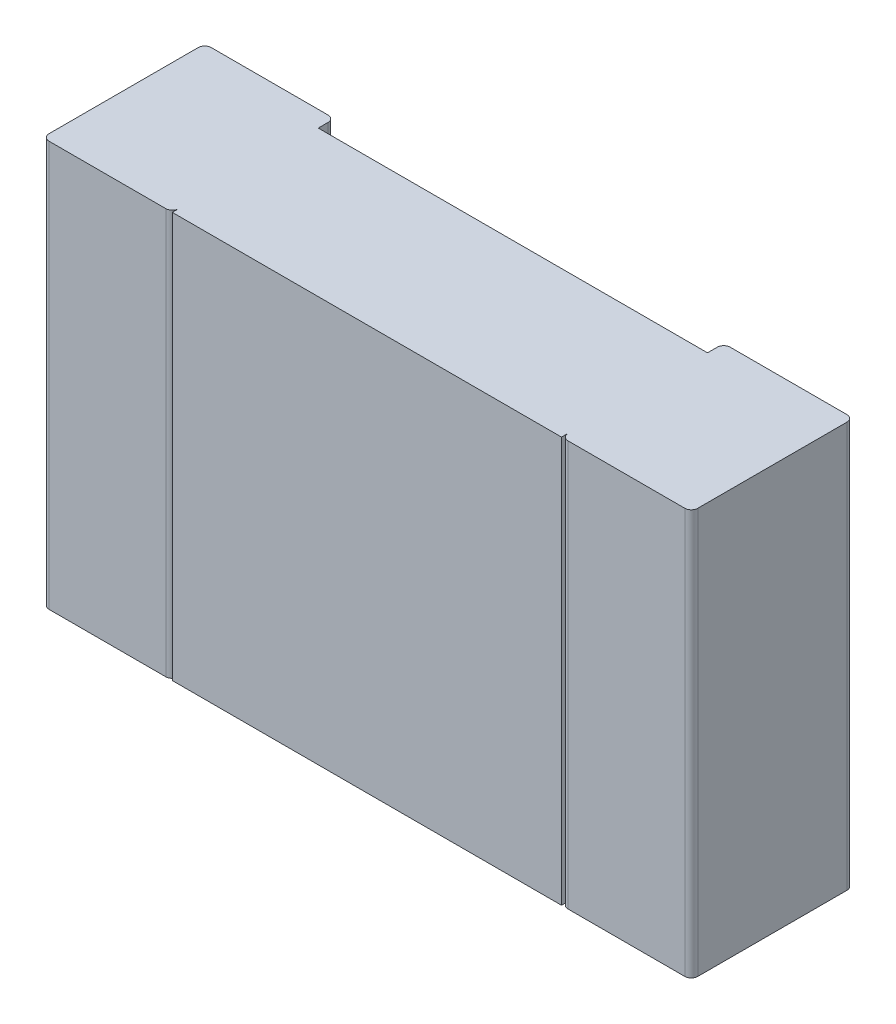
ISO-10303-21;
HEADER;
FILE_DESCRIPTION(('STEP AP214'),'2;1');
FILE_NAME('part.step','',(''),(''),'','','');
FILE_SCHEMA(('AUTOMOTIVE_DESIGN { 1 0 10303 214 1 1 1 1 }'));
ENDSEC;
DATA;
#1=APPLICATION_CONTEXT('core data for automotive mechanical design processes');
#2=APPLICATION_PROTOCOL_DEFINITION('international standard','automotive_design',2000,#1);
#3=PRODUCT_CONTEXT('',#1,'mechanical');
#4=PRODUCT('Part','Part','',(#3));
#5=PRODUCT_RELATED_PRODUCT_CATEGORY('part','',(#4));
#6=PRODUCT_DEFINITION_FORMATION('','',#4);
#7=PRODUCT_DEFINITION_CONTEXT('part definition',#1,'design');
#8=PRODUCT_DEFINITION('design','',#6,#7);
#9=PRODUCT_DEFINITION_SHAPE('','',#8);
#10=(LENGTH_UNIT() NAMED_UNIT(*) SI_UNIT(.MILLI.,.METRE.));
#11=(NAMED_UNIT(*) PLANE_ANGLE_UNIT() SI_UNIT($,.RADIAN.));
#12=(NAMED_UNIT(*) SI_UNIT($,.STERADIAN.) SOLID_ANGLE_UNIT());
#13=UNCERTAINTY_MEASURE_WITH_UNIT(LENGTH_MEASURE(1.E-05),#10,'distance_accuracy_value','');
#14=(GEOMETRIC_REPRESENTATION_CONTEXT(3) GLOBAL_UNCERTAINTY_ASSIGNED_CONTEXT((#13)) GLOBAL_UNIT_ASSIGNED_CONTEXT((#10,
#11,#12)) REPRESENTATION_CONTEXT('',''));
#15=CARTESIAN_POINT('',(0.,0.,0.));
#16=DIRECTION('',(0.,0.,1.));
#17=DIRECTION('',(1.,0.,0.));
#18=AXIS2_PLACEMENT_3D('',#15,#16,#17);
#19=CARTESIAN_POINT('',(-1.,-0.625,0.));
#20=DIRECTION('',(0.,0.,1.));
#21=DIRECTION('',(1.,0.,0.));
#22=AXIS2_PLACEMENT_3D('',#19,#20,#21);
#23=PLANE('',#22);
#24=DIRECTION('',(1.,0.,0.));
#25=VECTOR('',#24,1.);
#26=CARTESIAN_POINT('',(-1.,-0.625,0.));
#27=LINE('',#26,#25);
#28=CARTESIAN_POINT('',(-0.62,-0.625,0.));
#29=VERTEX_POINT('',#28);
#30=CARTESIAN_POINT('',(-0.98,-0.625,0.));
#31=VERTEX_POINT('',#30);
#32=EDGE_CURVE('E176',#29,#31,#27,.F.);
#33=ORIENTED_EDGE('',*,*,#32,.T.);
#34=DIRECTION('',(0.,1.,0.));
#35=VECTOR('',#34,1.);
#36=CARTESIAN_POINT('',(-0.98,-0.625,0.));
#37=LINE('',#36,#35);
#38=CARTESIAN_POINT('',(-0.98,0.625,0.));
#39=VERTEX_POINT('',#38);
#40=EDGE_CURVE('E151',#39,#31,#37,.F.);
#41=ORIENTED_EDGE('',*,*,#40,.F.);
#42=DIRECTION('',(1.,0.,0.));
#43=VECTOR('',#42,1.);
#44=CARTESIAN_POINT('',(-1.,0.625,0.));
#45=LINE('',#44,#43);
#46=CARTESIAN_POINT('',(-0.62,0.625,0.));
#47=VERTEX_POINT('',#46);
#48=EDGE_CURVE('E286',#47,#39,#45,.F.);
#49=ORIENTED_EDGE('',*,*,#48,.F.);
#50=DIRECTION('',(0.,1.,0.));
#51=VECTOR('',#50,1.);
#52=CARTESIAN_POINT('',(-0.62,-0.625,0.));
#53=LINE('',#52,#51);
#54=EDGE_CURVE('E177',#29,#47,#53,.T.);
#55=ORIENTED_EDGE('',*,*,#54,.F.);
#56=EDGE_LOOP('',(#33,#41,#49,#55));
#57=FACE_BOUND('',#56,.T.);
#58=ADVANCED_FACE('F17',(#57),#23,.F.);
#59=CARTESIAN_POINT('',(-0.98,-0.625,0.02));
#60=DIRECTION('',(0.,1.,0.));
#61=DIRECTION('',(0.,0.,1.));
#62=AXIS2_PLACEMENT_3D('',#59,#60,#61);
#63=CYLINDRICAL_SURFACE('',#62,0.02);
#64=ORIENTED_EDGE('',*,*,#40,.T.);
#65=CARTESIAN_POINT('',(-0.98,-0.625,0.02));
#66=DIRECTION('',(0.,1.,0.));
#67=DIRECTION('',(0.,0.,1.));
#68=AXIS2_PLACEMENT_3D('',#65,#66,#67);
#69=CIRCLE('',#68,0.02);
#70=CARTESIAN_POINT('',(-1.,-0.625,0.02));
#71=VERTEX_POINT('',#70);
#72=EDGE_CURVE('E20',#31,#71,#69,.T.);
#73=ORIENTED_EDGE('',*,*,#72,.T.);
#74=DIRECTION('',(0.,1.,0.));
#75=VECTOR('',#74,1.);
#76=CARTESIAN_POINT('',(-1.,-0.625,0.02));
#77=LINE('',#76,#75);
#78=CARTESIAN_POINT('',(-1.,0.625,0.02));
#79=VERTEX_POINT('',#78);
#80=EDGE_CURVE('E158',#71,#79,#77,.T.);
#81=ORIENTED_EDGE('',*,*,#80,.T.);
#82=CARTESIAN_POINT('',(-0.98,0.625,0.02));
#83=DIRECTION('',(0.,1.,0.));
#84=DIRECTION('',(0.,0.,1.));
#85=AXIS2_PLACEMENT_3D('',#82,#83,#84);
#86=CIRCLE('',#85,0.02);
#87=EDGE_CURVE('E284',#39,#79,#86,.T.);
#88=ORIENTED_EDGE('',*,*,#87,.F.);
#89=EDGE_LOOP('',(#64,#73,#81,#88));
#90=FACE_BOUND('',#89,.T.);
#91=ADVANCED_FACE('F175',(#90),#63,.T.);
#92=CARTESIAN_POINT('',(-1.,-0.625,0.));
#93=DIRECTION('',(1.,0.,0.));
#94=DIRECTION('',(0.,0.,-1.));
#95=AXIS2_PLACEMENT_3D('',#92,#93,#94);
#96=PLANE('',#95);
#97=DIRECTION('',(0.,0.,1.));
#98=VECTOR('',#97,1.);
#99=CARTESIAN_POINT('',(-1.,0.625,0.));
#100=LINE('',#99,#98);
#101=CARTESIAN_POINT('',(-1.,0.625,0.48));
#102=VERTEX_POINT('',#101);
#103=EDGE_CURVE('E163',#79,#102,#100,.T.);
#104=ORIENTED_EDGE('',*,*,#103,.F.);
#105=ORIENTED_EDGE('',*,*,#80,.F.);
#106=DIRECTION('',(0.,0.,1.));
#107=VECTOR('',#106,1.);
#108=CARTESIAN_POINT('',(-1.,-0.625,0.));
#109=LINE('',#108,#107);
#110=CARTESIAN_POINT('',(-1.,-0.625,0.48));
#111=VERTEX_POINT('',#110);
#112=EDGE_CURVE('E162',#71,#111,#109,.T.);
#113=ORIENTED_EDGE('',*,*,#112,.T.);
#114=DIRECTION('',(0.,1.,0.));
#115=VECTOR('',#114,1.);
#116=CARTESIAN_POINT('',(-1.,-0.625,0.48));
#117=LINE('',#116,#115);
#118=EDGE_CURVE('E164',#102,#111,#117,.F.);
#119=ORIENTED_EDGE('',*,*,#118,.F.);
#120=EDGE_LOOP('',(#104,#105,#113,#119));
#121=FACE_BOUND('',#120,.T.);
#122=ADVANCED_FACE('F160',(#121),#96,.F.);
#123=CARTESIAN_POINT('',(-0.98,-0.625,0.48));
#124=DIRECTION('',(0.,1.,0.));
#125=DIRECTION('',(0.,0.,1.));
#126=AXIS2_PLACEMENT_3D('',#123,#124,#125);
#127=CYLINDRICAL_SURFACE('',#126,0.02);
#128=CARTESIAN_POINT('',(-0.98,0.625,0.48));
#129=DIRECTION('',(0.,1.,0.));
#130=DIRECTION('',(0.,0.,1.));
#131=AXIS2_PLACEMENT_3D('',#128,#129,#130);
#132=CIRCLE('',#131,0.02);
#133=CARTESIAN_POINT('',(-0.98,0.625,0.5));
#134=VERTEX_POINT('',#133);
#135=EDGE_CURVE('E282',#102,#134,#132,.T.);
#136=ORIENTED_EDGE('',*,*,#135,.F.);
#137=ORIENTED_EDGE('',*,*,#118,.T.);
#138=CARTESIAN_POINT('',(-0.98,-0.625,0.48));
#139=DIRECTION('',(0.,1.,0.));
#140=DIRECTION('',(0.,0.,1.));
#141=AXIS2_PLACEMENT_3D('',#138,#139,#140);
#142=CIRCLE('',#141,0.02);
#143=CARTESIAN_POINT('',(-0.98,-0.625,0.5));
#144=VERTEX_POINT('',#143);
#145=EDGE_CURVE('E173',#111,#144,#142,.T.);
#146=ORIENTED_EDGE('',*,*,#145,.T.);
#147=DIRECTION('',(0.,1.,0.));
#148=VECTOR('',#147,1.);
#149=CARTESIAN_POINT('',(-0.98,-0.625,0.5));
#150=LINE('',#149,#148);
#151=EDGE_CURVE('E246',#134,#144,#150,.F.);
#152=ORIENTED_EDGE('',*,*,#151,.F.);
#153=EDGE_LOOP('',(#136,#137,#146,#152));
#154=FACE_BOUND('',#153,.T.);
#155=ADVANCED_FACE('F378',(#154),#127,.T.);
#156=CARTESIAN_POINT('',(-1.,-0.625,0.5));
#157=DIRECTION('',(0.,0.,1.));
#158=DIRECTION('',(1.,0.,0.));
#159=AXIS2_PLACEMENT_3D('',#156,#157,#158);
#160=PLANE('',#159);
#161=DIRECTION('',(1.,0.,0.));
#162=VECTOR('',#161,1.);
#163=CARTESIAN_POINT('',(-1.,-0.625,0.5));
#164=LINE('',#163,#162);
#165=CARTESIAN_POINT('',(-0.62,-0.625,0.5));
#166=VERTEX_POINT('',#165);
#167=EDGE_CURVE('E302',#144,#166,#164,.T.);
#168=ORIENTED_EDGE('',*,*,#167,.T.);
#169=DIRECTION('',(0.,1.,0.));
#170=VECTOR('',#169,1.);
#171=CARTESIAN_POINT('',(-0.62,-0.625,0.5));
#172=LINE('',#171,#170);
#173=CARTESIAN_POINT('',(-0.62,0.625,0.5));
#174=VERTEX_POINT('',#173);
#175=EDGE_CURVE('E243',#174,#166,#172,.F.);
#176=ORIENTED_EDGE('',*,*,#175,.F.);
#177=DIRECTION('',(1.,0.,0.));
#178=VECTOR('',#177,1.);
#179=CARTESIAN_POINT('',(-1.,0.625,0.5));
#180=LINE('',#179,#178);
#181=EDGE_CURVE('E281',#134,#174,#180,.T.);
#182=ORIENTED_EDGE('',*,*,#181,.F.);
#183=ORIENTED_EDGE('',*,*,#151,.T.);
#184=EDGE_LOOP('',(#168,#176,#182,#183));
#185=FACE_BOUND('',#184,.T.);
#186=ADVANCED_FACE('F380',(#185),#160,.T.);
#187=CARTESIAN_POINT('',(-0.62,-0.625,0.48));
#188=DIRECTION('',(0.,1.,0.));
#189=DIRECTION('',(0.,0.,1.));
#190=AXIS2_PLACEMENT_3D('',#187,#188,#189);
#191=CYLINDRICAL_SURFACE('',#190,0.02);
#192=ORIENTED_EDGE('',*,*,#175,.T.);
#193=CARTESIAN_POINT('',(-0.62,-0.625,0.48));
#194=DIRECTION('',(0.,1.,0.));
#195=DIRECTION('',(0.,0.,1.));
#196=AXIS2_PLACEMENT_3D('',#193,#194,#195);
#197=CIRCLE('',#196,0.02);
#198=CARTESIAN_POINT('',(-0.6,-0.625,0.48));
#199=VERTEX_POINT('',#198);
#200=EDGE_CURVE('E300',#166,#199,#197,.T.);
#201=ORIENTED_EDGE('',*,*,#200,.T.);
#202=DIRECTION('',(0.,1.,0.));
#203=VECTOR('',#202,1.);
#204=CARTESIAN_POINT('',(-0.6,-0.625,0.48));
#205=LINE('',#204,#203);
#206=CARTESIAN_POINT('',(-0.6,0.625,0.48));
#207=VERTEX_POINT('',#206);
#208=EDGE_CURVE('E235',#199,#207,#205,.T.);
#209=ORIENTED_EDGE('',*,*,#208,.T.);
#210=CARTESIAN_POINT('',(-0.62,0.625,0.48));
#211=DIRECTION('',(0.,1.,0.));
#212=DIRECTION('',(0.,0.,1.));
#213=AXIS2_PLACEMENT_3D('',#210,#211,#212);
#214=CIRCLE('',#213,0.02);
#215=EDGE_CURVE('E279',#174,#207,#214,.T.);
#216=ORIENTED_EDGE('',*,*,#215,.F.);
#217=EDGE_LOOP('',(#192,#201,#209,#216));
#218=FACE_BOUND('',#217,.T.);
#219=ADVANCED_FACE('F385',(#218),#191,.T.);
#220=CARTESIAN_POINT('',(-0.6,-0.625,0.45));
#221=DIRECTION('',(1.,0.,0.));
#222=DIRECTION('',(0.,0.,-1.));
#223=AXIS2_PLACEMENT_3D('',#220,#221,#222);
#224=PLANE('',#223);
#225=DIRECTION('',(0.,0.,1.));
#226=VECTOR('',#225,1.);
#227=CARTESIAN_POINT('',(-0.6,0.625,0.45));
#228=LINE('',#227,#226);
#229=CARTESIAN_POINT('',(-0.6,0.625,0.5));
#230=VERTEX_POINT('',#229);
#231=EDGE_CURVE('E231',#207,#230,#228,.T.);
#232=ORIENTED_EDGE('',*,*,#231,.F.);
#233=ORIENTED_EDGE('',*,*,#208,.F.);
#234=DIRECTION('',(0.,0.,1.));
#235=VECTOR('',#234,1.);
#236=CARTESIAN_POINT('',(-0.6,-0.625,0.45));
#237=LINE('',#236,#235);
#238=CARTESIAN_POINT('',(-0.6,-0.625,0.5));
#239=VERTEX_POINT('',#238);
#240=EDGE_CURVE('E259',#199,#239,#237,.T.);
#241=ORIENTED_EDGE('',*,*,#240,.T.);
#242=DIRECTION('',(0.,1.,0.));
#243=VECTOR('',#242,1.);
#244=CARTESIAN_POINT('',(-0.6,-0.625,0.5));
#245=LINE('',#244,#243);
#246=EDGE_CURVE('E227',#230,#239,#245,.F.);
#247=ORIENTED_EDGE('',*,*,#246,.F.);
#248=EDGE_LOOP('',(#232,#233,#241,#247));
#249=FACE_BOUND('',#248,.T.);
#250=ADVANCED_FACE('F388',(#249),#224,.F.);
#251=CARTESIAN_POINT('',(-0.6,-0.625,0.5));
#252=DIRECTION('',(0.,0.,1.));
#253=DIRECTION('',(1.,0.,0.));
#254=AXIS2_PLACEMENT_3D('',#251,#252,#253);
#255=PLANE('',#254);
#256=DIRECTION('',(0.,1.,0.));
#257=VECTOR('',#256,1.);
#258=CARTESIAN_POINT('',(0.6,-0.625,0.5));
#259=LINE('',#258,#257);
#260=CARTESIAN_POINT('',(0.6,0.625,0.5));
#261=VERTEX_POINT('',#260);
#262=CARTESIAN_POINT('',(0.6,-0.625,0.5));
#263=VERTEX_POINT('',#262);
#264=EDGE_CURVE('E215',#261,#263,#259,.F.);
#265=ORIENTED_EDGE('',*,*,#264,.F.);
#266=DIRECTION('',(1.,0.,0.));
#267=VECTOR('',#266,1.);
#268=CARTESIAN_POINT('',(-0.6,0.625,0.5));
#269=LINE('',#268,#267);
#270=EDGE_CURVE('E219',#230,#261,#269,.T.);
#271=ORIENTED_EDGE('',*,*,#270,.F.);
#272=ORIENTED_EDGE('',*,*,#246,.T.);
#273=DIRECTION('',(1.,0.,0.));
#274=VECTOR('',#273,1.);
#275=CARTESIAN_POINT('',(-0.6,-0.625,0.5));
#276=LINE('',#275,#274);
#277=EDGE_CURVE('E254',#239,#263,#276,.T.);
#278=ORIENTED_EDGE('',*,*,#277,.T.);
#279=EDGE_LOOP('',(#265,#271,#272,#278));
#280=FACE_BOUND('',#279,.T.);
#281=ADVANCED_FACE('F393',(#280),#255,.T.);
#282=CARTESIAN_POINT('',(0.6,-0.625,0.45));
#283=DIRECTION('',(1.,0.,0.));
#284=DIRECTION('',(0.,0.,-1.));
#285=AXIS2_PLACEMENT_3D('',#282,#283,#284);
#286=PLANE('',#285);
#287=DIRECTION('',(0.,0.,1.));
#288=VECTOR('',#287,1.);
#289=CARTESIAN_POINT('',(0.6,0.625,0.45));
#290=LINE('',#289,#288);
#291=CARTESIAN_POINT('',(0.6,0.625,0.48));
#292=VERTEX_POINT('',#291);
#293=EDGE_CURVE('E216',#261,#292,#290,.F.);
#294=ORIENTED_EDGE('',*,*,#293,.F.);
#295=ORIENTED_EDGE('',*,*,#264,.T.);
#296=DIRECTION('',(0.,0.,1.));
#297=VECTOR('',#296,1.);
#298=CARTESIAN_POINT('',(0.6,-0.625,0.45));
#299=LINE('',#298,#297);
#300=CARTESIAN_POINT('',(0.6,-0.625,0.48));
#301=VERTEX_POINT('',#300);
#302=EDGE_CURVE('E250',#263,#301,#299,.F.);
#303=ORIENTED_EDGE('',*,*,#302,.T.);
#304=DIRECTION('',(0.,1.,0.));
#305=VECTOR('',#304,1.);
#306=CARTESIAN_POINT('',(0.6,-0.625,0.48));
#307=LINE('',#306,#305);
#308=EDGE_CURVE('E213',#292,#301,#307,.F.);
#309=ORIENTED_EDGE('',*,*,#308,.F.);
#310=EDGE_LOOP('',(#294,#295,#303,#309));
#311=FACE_BOUND('',#310,.T.);
#312=ADVANCED_FACE('F399',(#311),#286,.T.);
#313=CARTESIAN_POINT('',(0.6,-0.625,0.));
#314=DIRECTION('',(0.,0.,1.));
#315=DIRECTION('',(1.,0.,0.));
#316=AXIS2_PLACEMENT_3D('',#313,#314,#315);
#317=PLANE('',#316);
#318=DIRECTION('',(1.,0.,0.));
#319=VECTOR('',#318,1.);
#320=CARTESIAN_POINT('',(0.6,-0.625,0.));
#321=LINE('',#320,#319);
#322=CARTESIAN_POINT('',(0.98,-0.625,0.));
#323=VERTEX_POINT('',#322);
#324=CARTESIAN_POINT('',(0.62,-0.625,0.));
#325=VERTEX_POINT('',#324);
#326=EDGE_CURVE('E253',#323,#325,#321,.F.);
#327=ORIENTED_EDGE('',*,*,#326,.T.);
#328=DIRECTION('',(0.,1.,0.));
#329=VECTOR('',#328,1.);
#330=CARTESIAN_POINT('',(0.62,-0.625,0.));
#331=LINE('',#330,#329);
#332=CARTESIAN_POINT('',(0.62,0.625,0.));
#333=VERTEX_POINT('',#332);
#334=EDGE_CURVE('E222',#333,#325,#331,.F.);
#335=ORIENTED_EDGE('',*,*,#334,.F.);
#336=DIRECTION('',(1.,0.,0.));
#337=VECTOR('',#336,1.);
#338=CARTESIAN_POINT('',(0.6,0.625,0.));
#339=LINE('',#338,#337);
#340=CARTESIAN_POINT('',(0.98,0.625,0.));
#341=VERTEX_POINT('',#340);
#342=EDGE_CURVE('E218',#341,#333,#339,.F.);
#343=ORIENTED_EDGE('',*,*,#342,.F.);
#344=DIRECTION('',(0.,1.,0.));
#345=VECTOR('',#344,1.);
#346=CARTESIAN_POINT('',(0.98,-0.625,0.));
#347=LINE('',#346,#345);
#348=EDGE_CURVE('E204',#323,#341,#347,.T.);
#349=ORIENTED_EDGE('',*,*,#348,.F.);
#350=EDGE_LOOP('',(#327,#335,#343,#349));
#351=FACE_BOUND('',#350,.T.);
#352=ADVANCED_FACE('F355',(#351),#317,.F.);
#353=CARTESIAN_POINT('',(0.62,-0.625,0.48));
#354=DIRECTION('',(0.,1.,0.));
#355=DIRECTION('',(0.,0.,1.));
#356=AXIS2_PLACEMENT_3D('',#353,#354,#355);
#357=CYLINDRICAL_SURFACE('',#356,0.02);
#358=CARTESIAN_POINT('',(0.62,0.625,0.48));
#359=DIRECTION('',(0.,1.,0.));
#360=DIRECTION('',(0.,0.,1.));
#361=AXIS2_PLACEMENT_3D('',#358,#359,#360);
#362=CIRCLE('',#361,0.02);
#363=CARTESIAN_POINT('',(0.62,0.625,0.5));
#364=VERTEX_POINT('',#363);
#365=EDGE_CURVE('E273',#292,#364,#362,.T.);
#366=ORIENTED_EDGE('',*,*,#365,.F.);
#367=ORIENTED_EDGE('',*,*,#308,.T.);
#368=CARTESIAN_POINT('',(0.62,-0.625,0.48));
#369=DIRECTION('',(0.,1.,0.));
#370=DIRECTION('',(0.,0.,1.));
#371=AXIS2_PLACEMENT_3D('',#368,#369,#370);
#372=CIRCLE('',#371,0.02);
#373=CARTESIAN_POINT('',(0.62,-0.625,0.5));
#374=VERTEX_POINT('',#373);
#375=EDGE_CURVE('E295',#301,#374,#372,.T.);
#376=ORIENTED_EDGE('',*,*,#375,.T.);
#377=DIRECTION('',(0.,1.,0.));
#378=VECTOR('',#377,1.);
#379=CARTESIAN_POINT('',(0.62,-0.625,0.5));
#380=LINE('',#379,#378);
#381=EDGE_CURVE('E211',#364,#374,#380,.F.);
#382=ORIENTED_EDGE('',*,*,#381,.F.);
#383=EDGE_LOOP('',(#366,#367,#376,#382));
#384=FACE_BOUND('',#383,.T.);
#385=ADVANCED_FACE('F403',(#384),#357,.T.);
#386=CARTESIAN_POINT('',(0.6,-0.625,0.5));
#387=DIRECTION('',(0.,0.,1.));
#388=DIRECTION('',(1.,0.,0.));
#389=AXIS2_PLACEMENT_3D('',#386,#387,#388);
#390=PLANE('',#389);
#391=DIRECTION('',(1.,0.,0.));
#392=VECTOR('',#391,1.);
#393=CARTESIAN_POINT('',(0.6,-0.625,0.5));
#394=LINE('',#393,#392);
#395=CARTESIAN_POINT('',(0.98,-0.625,0.5));
#396=VERTEX_POINT('',#395);
#397=EDGE_CURVE('E294',#374,#396,#394,.T.);
#398=ORIENTED_EDGE('',*,*,#397,.T.);
#399=DIRECTION('',(0.,1.,0.));
#400=VECTOR('',#399,1.);
#401=CARTESIAN_POINT('',(0.98,-0.625,0.5));
#402=LINE('',#401,#400);
#403=CARTESIAN_POINT('',(0.98,0.625,0.5));
#404=VERTEX_POINT('',#403);
#405=EDGE_CURVE('E209',#404,#396,#402,.F.);
#406=ORIENTED_EDGE('',*,*,#405,.F.);
#407=DIRECTION('',(1.,0.,0.));
#408=VECTOR('',#407,1.);
#409=CARTESIAN_POINT('',(0.6,0.625,0.5));
#410=LINE('',#409,#408);
#411=EDGE_CURVE('E272',#364,#404,#410,.T.);
#412=ORIENTED_EDGE('',*,*,#411,.F.);
#413=ORIENTED_EDGE('',*,*,#381,.T.);
#414=EDGE_LOOP('',(#398,#406,#412,#413));
#415=FACE_BOUND('',#414,.T.);
#416=ADVANCED_FACE('F408',(#415),#390,.T.);
#417=CARTESIAN_POINT('',(0.98,-0.625,0.48));
#418=DIRECTION('',(0.,1.,0.));
#419=DIRECTION('',(0.,0.,1.));
#420=AXIS2_PLACEMENT_3D('',#417,#418,#419);
#421=CYLINDRICAL_SURFACE('',#420,0.02);
#422=ORIENTED_EDGE('',*,*,#405,.T.);
#423=CARTESIAN_POINT('',(0.98,-0.625,0.48));
#424=DIRECTION('',(0.,1.,0.));
#425=DIRECTION('',(0.,0.,1.));
#426=AXIS2_PLACEMENT_3D('',#423,#424,#425);
#427=CIRCLE('',#426,0.02);
#428=CARTESIAN_POINT('',(1.,-0.625,0.48));
#429=VERTEX_POINT('',#428);
#430=EDGE_CURVE('E291',#396,#429,#427,.T.);
#431=ORIENTED_EDGE('',*,*,#430,.T.);
#432=DIRECTION('',(0.,1.,0.));
#433=VECTOR('',#432,1.);
#434=CARTESIAN_POINT('',(1.,-0.625,0.48));
#435=LINE('',#434,#433);
#436=CARTESIAN_POINT('',(1.,0.625,0.48));
#437=VERTEX_POINT('',#436);
#438=EDGE_CURVE('E206',#437,#429,#435,.F.);
#439=ORIENTED_EDGE('',*,*,#438,.F.);
#440=CARTESIAN_POINT('',(0.98,0.625,0.48));
#441=DIRECTION('',(0.,1.,0.));
#442=DIRECTION('',(0.,0.,1.));
#443=AXIS2_PLACEMENT_3D('',#440,#441,#442);
#444=CIRCLE('',#443,0.02);
#445=EDGE_CURVE('E270',#404,#437,#444,.T.);
#446=ORIENTED_EDGE('',*,*,#445,.F.);
#447=EDGE_LOOP('',(#422,#431,#439,#446));
#448=FACE_BOUND('',#447,.T.);
#449=ADVANCED_FACE('F411',(#448),#421,.T.);
#450=CARTESIAN_POINT('',(1.,-0.625,0.));
#451=DIRECTION('',(1.,0.,0.));
#452=DIRECTION('',(0.,0.,-1.));
#453=AXIS2_PLACEMENT_3D('',#450,#451,#452);
#454=PLANE('',#453);
#455=DIRECTION('',(0.,0.,1.));
#456=VECTOR('',#455,1.);
#457=CARTESIAN_POINT('',(1.,0.625,0.));
#458=LINE('',#457,#456);
#459=CARTESIAN_POINT('',(1.,0.625,0.02));
#460=VERTEX_POINT('',#459);
#461=EDGE_CURVE('E269',#437,#460,#458,.F.);
#462=ORIENTED_EDGE('',*,*,#461,.F.);
#463=ORIENTED_EDGE('',*,*,#438,.T.);
#464=DIRECTION('',(0.,0.,1.));
#465=VECTOR('',#464,1.);
#466=CARTESIAN_POINT('',(1.,-0.625,0.));
#467=LINE('',#466,#465);
#468=CARTESIAN_POINT('',(1.,-0.625,0.02));
#469=VERTEX_POINT('',#468);
#470=EDGE_CURVE('E290',#429,#469,#467,.F.);
#471=ORIENTED_EDGE('',*,*,#470,.T.);
#472=DIRECTION('',(0.,1.,0.));
#473=VECTOR('',#472,1.);
#474=CARTESIAN_POINT('',(1.,-0.625,0.02));
#475=LINE('',#474,#473);
#476=EDGE_CURVE('E181',#460,#469,#475,.F.);
#477=ORIENTED_EDGE('',*,*,#476,.F.);
#478=EDGE_LOOP('',(#462,#463,#471,#477));
#479=FACE_BOUND('',#478,.T.);
#480=ADVANCED_FACE('F348',(#479),#454,.T.);
#481=CARTESIAN_POINT('',(0.98,-0.625,0.02));
#482=DIRECTION('',(0.,1.,0.));
#483=DIRECTION('',(0.,0.,1.));
#484=AXIS2_PLACEMENT_3D('',#481,#482,#483);
#485=CYLINDRICAL_SURFACE('',#484,0.02);
#486=CARTESIAN_POINT('',(0.98,0.625,0.02));
#487=DIRECTION('',(0.,1.,0.));
#488=DIRECTION('',(0.,0.,1.));
#489=AXIS2_PLACEMENT_3D('',#486,#487,#488);
#490=CIRCLE('',#489,0.02);
#491=EDGE_CURVE('E189',#460,#341,#490,.T.);
#492=ORIENTED_EDGE('',*,*,#491,.F.);
#493=ORIENTED_EDGE('',*,*,#476,.T.);
#494=CARTESIAN_POINT('',(0.98,-0.625,0.02));
#495=DIRECTION('',(0.,1.,0.));
#496=DIRECTION('',(0.,0.,1.));
#497=AXIS2_PLACEMENT_3D('',#494,#495,#496);
#498=CIRCLE('',#497,0.02);
#499=EDGE_CURVE('E225',#469,#323,#498,.T.);
#500=ORIENTED_EDGE('',*,*,#499,.T.);
#501=ORIENTED_EDGE('',*,*,#348,.T.);
#502=EDGE_LOOP('',(#492,#493,#500,#501));
#503=FACE_BOUND('',#502,.T.);
#504=ADVANCED_FACE('F352',(#503),#485,.T.);
#505=CARTESIAN_POINT('',(-0.62,-0.625,0.02));
#506=DIRECTION('',(0.,1.,0.));
#507=DIRECTION('',(0.,0.,1.));
#508=AXIS2_PLACEMENT_3D('',#505,#506,#507);
#509=CYLINDRICAL_SURFACE('',#508,0.02);
#510=CARTESIAN_POINT('',(-0.62,0.625,0.02));
#511=DIRECTION('',(0.,1.,0.));
#512=DIRECTION('',(0.,0.,1.));
#513=AXIS2_PLACEMENT_3D('',#510,#511,#512);
#514=CIRCLE('',#513,0.02);
#515=CARTESIAN_POINT('',(-0.6,0.625,0.02));
#516=VERTEX_POINT('',#515);
#517=EDGE_CURVE('E239',#516,#47,#514,.T.);
#518=ORIENTED_EDGE('',*,*,#517,.F.);
#519=DIRECTION('',(0.,1.,0.));
#520=VECTOR('',#519,1.);
#521=CARTESIAN_POINT('',(-0.6,-0.625,0.02));
#522=LINE('',#521,#520);
#523=CARTESIAN_POINT('',(-0.6,-0.625,0.02));
#524=VERTEX_POINT('',#523);
#525=EDGE_CURVE('E188',#524,#516,#522,.T.);
#526=ORIENTED_EDGE('',*,*,#525,.F.);
#527=CARTESIAN_POINT('',(-0.62,-0.625,0.02));
#528=DIRECTION('',(0.,1.,0.));
#529=DIRECTION('',(0.,0.,1.));
#530=AXIS2_PLACEMENT_3D('',#527,#528,#529);
#531=CIRCLE('',#530,0.02);
#532=EDGE_CURVE('E264',#524,#29,#531,.T.);
#533=ORIENTED_EDGE('',*,*,#532,.T.);
#534=ORIENTED_EDGE('',*,*,#54,.T.);
#535=EDGE_LOOP('',(#518,#526,#533,#534));
#536=FACE_BOUND('',#535,.T.);
#537=ADVANCED_FACE('F376',(#536),#509,.T.);
#538=CARTESIAN_POINT('',(0.62,-0.625,0.02));
#539=DIRECTION('',(0.,1.,0.));
#540=DIRECTION('',(0.,0.,1.));
#541=AXIS2_PLACEMENT_3D('',#538,#539,#540);
#542=CYLINDRICAL_SURFACE('',#541,0.02);
#543=ORIENTED_EDGE('',*,*,#334,.T.);
#544=CARTESIAN_POINT('',(0.62,-0.625,0.02));
#545=DIRECTION('',(0.,1.,0.));
#546=DIRECTION('',(0.,0.,1.));
#547=AXIS2_PLACEMENT_3D('',#544,#545,#546);
#548=CIRCLE('',#547,0.02);
#549=CARTESIAN_POINT('',(0.6,-0.625,0.02));
#550=VERTEX_POINT('',#549);
#551=EDGE_CURVE('E224',#325,#550,#548,.T.);
#552=ORIENTED_EDGE('',*,*,#551,.T.);
#553=DIRECTION('',(0.,1.,0.));
#554=VECTOR('',#553,1.);
#555=CARTESIAN_POINT('',(0.6,-0.625,0.02));
#556=LINE('',#555,#554);
#557=CARTESIAN_POINT('',(0.6,0.625,0.02));
#558=VERTEX_POINT('',#557);
#559=EDGE_CURVE('E323',#550,#558,#556,.T.);
#560=ORIENTED_EDGE('',*,*,#559,.T.);
#561=CARTESIAN_POINT('',(0.62,0.625,0.02));
#562=DIRECTION('',(0.,1.,0.));
#563=DIRECTION('',(0.,0.,1.));
#564=AXIS2_PLACEMENT_3D('',#561,#562,#563);
#565=CIRCLE('',#564,0.02);
#566=EDGE_CURVE('E275',#333,#558,#565,.T.);
#567=ORIENTED_EDGE('',*,*,#566,.F.);
#568=EDGE_LOOP('',(#543,#552,#560,#567));
#569=FACE_BOUND('',#568,.T.);
#570=ADVANCED_FACE('F364',(#569),#542,.T.);
#571=CARTESIAN_POINT('',(-0.6,-0.625,0.));
#572=DIRECTION('',(1.,0.,0.));
#573=DIRECTION('',(0.,0.,-1.));
#574=AXIS2_PLACEMENT_3D('',#571,#572,#573);
#575=PLANE('',#574);
#576=DIRECTION('',(0.,0.,-1.));
#577=VECTOR('',#576,1.);
#578=CARTESIAN_POINT('',(-0.6,0.625,0.));
#579=LINE('',#578,#577);
#580=CARTESIAN_POINT('',(-0.6,0.625,0.05));
#581=VERTEX_POINT('',#580);
#582=EDGE_CURVE('E199',#516,#581,#579,.F.);
#583=ORIENTED_EDGE('',*,*,#582,.T.);
#584=DIRECTION('',(0.,1.,0.));
#585=VECTOR('',#584,1.);
#586=CARTESIAN_POINT('',(-0.6,-0.625,0.05));
#587=LINE('',#586,#585);
#588=CARTESIAN_POINT('',(-0.6,-0.625,0.05));
#589=VERTEX_POINT('',#588);
#590=EDGE_CURVE('E192',#581,#589,#587,.F.);
#591=ORIENTED_EDGE('',*,*,#590,.T.);
#592=DIRECTION('',(0.,0.,-1.));
#593=VECTOR('',#592,1.);
#594=CARTESIAN_POINT('',(-0.6,-0.625,0.));
#595=LINE('',#594,#593);
#596=EDGE_CURVE('E185',#589,#524,#595,.T.);
#597=ORIENTED_EDGE('',*,*,#596,.T.);
#598=ORIENTED_EDGE('',*,*,#525,.T.);
#599=EDGE_LOOP('',(#583,#591,#597,#598));
#600=FACE_BOUND('',#599,.T.);
#601=ADVANCED_FACE('F373',(#600),#575,.T.);
#602=CARTESIAN_POINT('',(-0.95,-0.625,0.05));
#603=DIRECTION('',(0.,1.,0.));
#604=DIRECTION('',(0.,0.,1.));
#605=AXIS2_PLACEMENT_3D('',#602,#603,#604);
#606=PLANE('',#605);
#607=ORIENTED_EDGE('',*,*,#240,.F.);
#608=ORIENTED_EDGE('',*,*,#200,.F.);
#609=ORIENTED_EDGE('',*,*,#167,.F.);
#610=ORIENTED_EDGE('',*,*,#145,.F.);
#611=ORIENTED_EDGE('',*,*,#112,.F.);
#612=ORIENTED_EDGE('',*,*,#72,.F.);
#613=ORIENTED_EDGE('',*,*,#32,.F.);
#614=ORIENTED_EDGE('',*,*,#532,.F.);
#615=ORIENTED_EDGE('',*,*,#596,.F.);
#616=DIRECTION('',(1.,0.,0.));
#617=VECTOR('',#616,1.);
#618=CARTESIAN_POINT('',(-0.95,-0.625,0.05));
#619=LINE('',#618,#617);
#620=CARTESIAN_POINT('',(0.6,-0.625,0.05));
#621=VERTEX_POINT('',#620);
#622=EDGE_CURVE('E195',#589,#621,#619,.T.);
#623=ORIENTED_EDGE('',*,*,#622,.T.);
#624=DIRECTION('',(0.,0.,-1.));
#625=VECTOR('',#624,1.);
#626=CARTESIAN_POINT('',(0.6,-0.625,0.));
#627=LINE('',#626,#625);
#628=EDGE_CURVE('E201',#621,#550,#627,.T.);
#629=ORIENTED_EDGE('',*,*,#628,.T.);
#630=ORIENTED_EDGE('',*,*,#551,.F.);
#631=ORIENTED_EDGE('',*,*,#326,.F.);
#632=ORIENTED_EDGE('',*,*,#499,.F.);
#633=ORIENTED_EDGE('',*,*,#470,.F.);
#634=ORIENTED_EDGE('',*,*,#430,.F.);
#635=ORIENTED_EDGE('',*,*,#397,.F.);
#636=ORIENTED_EDGE('',*,*,#375,.F.);
#637=ORIENTED_EDGE('',*,*,#302,.F.);
#638=ORIENTED_EDGE('',*,*,#277,.F.);
#639=EDGE_LOOP('',(#607,#608,#609,#610,#611,#612,#613,#614,#615,#623,#629,#630,#631,#632,#633,
#634,#635,#636,#637,#638));
#640=FACE_BOUND('',#639,.T.);
#641=ADVANCED_FACE('F169',(#640),#606,.F.);
#642=CARTESIAN_POINT('',(0.6,-0.625,0.));
#643=DIRECTION('',(1.,0.,0.));
#644=DIRECTION('',(0.,0.,-1.));
#645=AXIS2_PLACEMENT_3D('',#642,#643,#644);
#646=PLANE('',#645);
#647=DIRECTION('',(0.,0.,-1.));
#648=VECTOR('',#647,1.);
#649=CARTESIAN_POINT('',(0.6,0.625,0.));
#650=LINE('',#649,#648);
#651=CARTESIAN_POINT('',(0.6,0.625,0.05));
#652=VERTEX_POINT('',#651);
#653=EDGE_CURVE('E34',#558,#652,#650,.F.);
#654=ORIENTED_EDGE('',*,*,#653,.F.);
#655=ORIENTED_EDGE('',*,*,#559,.F.);
#656=ORIENTED_EDGE('',*,*,#628,.F.);
#657=DIRECTION('',(0.,1.,0.));
#658=VECTOR('',#657,1.);
#659=CARTESIAN_POINT('',(0.6,-0.625,0.05));
#660=LINE('',#659,#658);
#661=EDGE_CURVE('E26',#621,#652,#660,.T.);
#662=ORIENTED_EDGE('',*,*,#661,.T.);
#663=EDGE_LOOP('',(#654,#655,#656,#662));
#664=FACE_BOUND('',#663,.T.);
#665=ADVANCED_FACE('F362',(#664),#646,.F.);
#666=CARTESIAN_POINT('',(-0.95,0.625,0.05));
#667=DIRECTION('',(0.,1.,0.));
#668=DIRECTION('',(0.,0.,1.));
#669=AXIS2_PLACEMENT_3D('',#666,#667,#668);
#670=PLANE('',#669);
#671=ORIENTED_EDGE('',*,*,#215,.T.);
#672=ORIENTED_EDGE('',*,*,#231,.T.);
#673=ORIENTED_EDGE('',*,*,#270,.T.);
#674=ORIENTED_EDGE('',*,*,#293,.T.);
#675=ORIENTED_EDGE('',*,*,#365,.T.);
#676=ORIENTED_EDGE('',*,*,#411,.T.);
#677=ORIENTED_EDGE('',*,*,#445,.T.);
#678=ORIENTED_EDGE('',*,*,#461,.T.);
#679=ORIENTED_EDGE('',*,*,#491,.T.);
#680=ORIENTED_EDGE('',*,*,#342,.T.);
#681=ORIENTED_EDGE('',*,*,#566,.T.);
#682=ORIENTED_EDGE('',*,*,#653,.T.);
#683=DIRECTION('',(1.,0.,0.));
#684=VECTOR('',#683,1.);
#685=CARTESIAN_POINT('',(-0.95,0.625,0.05));
#686=LINE('',#685,#684);
#687=EDGE_CURVE('E11',#652,#581,#686,.F.);
#688=ORIENTED_EDGE('',*,*,#687,.T.);
#689=ORIENTED_EDGE('',*,*,#582,.F.);
#690=ORIENTED_EDGE('',*,*,#517,.T.);
#691=ORIENTED_EDGE('',*,*,#48,.T.);
#692=ORIENTED_EDGE('',*,*,#87,.T.);
#693=ORIENTED_EDGE('',*,*,#103,.T.);
#694=ORIENTED_EDGE('',*,*,#135,.T.);
#695=ORIENTED_EDGE('',*,*,#181,.T.);
#696=EDGE_LOOP('',(#671,#672,#673,#674,#675,#676,#677,#678,#679,#680,#681,#682,#688,#689,#690,
#691,#692,#693,#694,#695));
#697=FACE_BOUND('',#696,.T.);
#698=ADVANCED_FACE('F342',(#697),#670,.T.);
#699=CARTESIAN_POINT('',(-0.95,-0.625,0.05));
#700=DIRECTION('',(0.,0.,1.));
#701=DIRECTION('',(1.,0.,0.));
#702=AXIS2_PLACEMENT_3D('',#699,#700,#701);
#703=PLANE('',#702);
#704=ORIENTED_EDGE('',*,*,#661,.F.);
#705=ORIENTED_EDGE('',*,*,#622,.F.);
#706=ORIENTED_EDGE('',*,*,#590,.F.);
#707=ORIENTED_EDGE('',*,*,#687,.F.);
#708=EDGE_LOOP('',(#704,#705,#706,#707));
#709=FACE_BOUND('',#708,.T.);
#710=ADVANCED_FACE('F367',(#709),#703,.F.);
#711=CLOSED_SHELL('',(#58,#91,#122,#155,#186,#219,#250,#281,#312,#352,#385,#416,#449,#480,#504,
#537,#570,#601,#641,#665,#698,#710));
#712=MANIFOLD_SOLID_BREP('B1',#711);
#713=ADVANCED_BREP_SHAPE_REPRESENTATION('',(#18,#712),#14);
#714=SHAPE_DEFINITION_REPRESENTATION(#9,#713);
ENDSEC;
END-ISO-10303-21;
